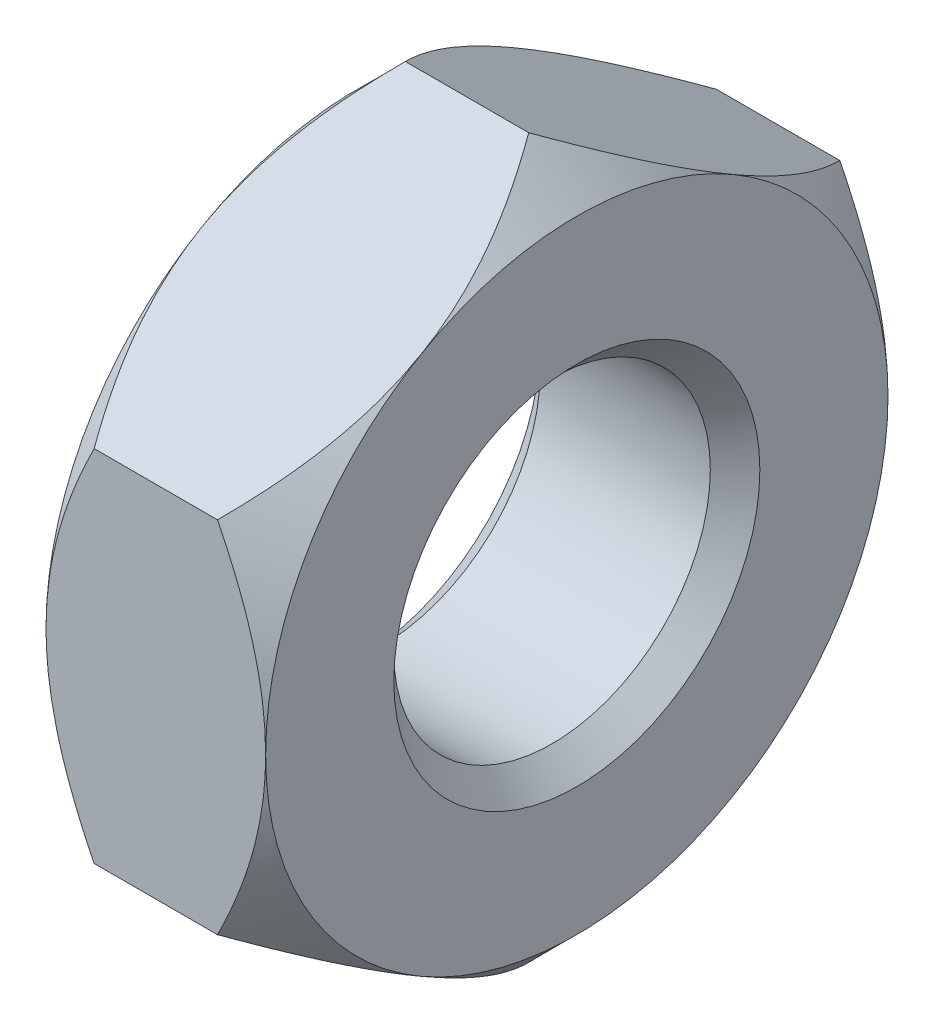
ISO-10303-21;
HEADER;
FILE_DESCRIPTION(('STEP AP214'),'2;1');
FILE_NAME('part.step','',(''),(''),'','','');
FILE_SCHEMA(('AUTOMOTIVE_DESIGN { 1 0 10303 214 1 1 1 1 }'));
ENDSEC;
DATA;
#1=APPLICATION_CONTEXT('core data for automotive mechanical design processes');
#2=APPLICATION_PROTOCOL_DEFINITION('international standard','automotive_design',2000,#1);
#3=PRODUCT_CONTEXT('',#1,'mechanical');
#4=PRODUCT('Part','Part','',(#3));
#5=PRODUCT_RELATED_PRODUCT_CATEGORY('part','',(#4));
#6=PRODUCT_DEFINITION_FORMATION('','',#4);
#7=PRODUCT_DEFINITION_CONTEXT('part definition',#1,'design');
#8=PRODUCT_DEFINITION('design','',#6,#7);
#9=PRODUCT_DEFINITION_SHAPE('','',#8);
#10=(LENGTH_UNIT() NAMED_UNIT(*) SI_UNIT(.MILLI.,.METRE.));
#11=(NAMED_UNIT(*) PLANE_ANGLE_UNIT() SI_UNIT($,.RADIAN.));
#12=(NAMED_UNIT(*) SI_UNIT($,.STERADIAN.) SOLID_ANGLE_UNIT());
#13=UNCERTAINTY_MEASURE_WITH_UNIT(LENGTH_MEASURE(1.E-05),#10,'distance_accuracy_value','');
#14=(GEOMETRIC_REPRESENTATION_CONTEXT(3) GLOBAL_UNCERTAINTY_ASSIGNED_CONTEXT((#13)) GLOBAL_UNIT_ASSIGNED_CONTEXT((#10,
#11,#12)) REPRESENTATION_CONTEXT('',''));
#15=CARTESIAN_POINT('',(0.,0.,0.));
#16=DIRECTION('',(0.,0.,1.));
#17=DIRECTION('',(1.,0.,0.));
#18=AXIS2_PLACEMENT_3D('',#15,#16,#17);
#19=CARTESIAN_POINT('',(1.7,0.,0.));
#20=DIRECTION('',(1.,0.,0.));
#21=DIRECTION('',(0.,0.,-1.));
#22=AXIS2_PLACEMENT_3D('',#19,#20,#21);
#23=CONICAL_SURFACE('',#22,10.2,0.785398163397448);
#24=CARTESIAN_POINT('',(1.31507004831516,-4.90736181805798,-8.5002));
#25=CARTESIAN_POINT('',(1.23071001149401,-4.9917346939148,-8.3540618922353));
#26=CARTESIAN_POINT('',(1.14892462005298,-5.07676599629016,-8.20678335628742));
#27=CARTESIAN_POINT('',(0.991319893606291,-5.24825298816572,-7.9097591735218));
#28=CARTESIAN_POINT('',(0.915503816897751,-5.33470942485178,-7.76001223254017));
#29=CARTESIAN_POINT('',(0.770333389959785,-5.50956203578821,-7.4571586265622));
#30=CARTESIAN_POINT('',(0.701018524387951,-5.59796648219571,-7.30403763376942));
#31=CARTESIAN_POINT('',(0.570360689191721,-5.77620843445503,-6.99531351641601));
#32=CARTESIAN_POINT('',(0.509016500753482,-5.86604571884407,-6.83971077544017));
#33=CARTESIAN_POINT('',(0.340317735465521,-6.13489147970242,-6.37405625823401));
#34=CARTESIAN_POINT('',(0.24589898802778,-6.31604623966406,-6.0602870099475));
#35=CARTESIAN_POINT('',(0.136690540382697,-6.59071980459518,-5.58453843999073));
#36=CARTESIAN_POINT('',(0.105705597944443,-6.68267601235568,-5.42526561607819));
#37=CARTESIAN_POINT('',(0.0552370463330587,-6.86737020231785,-5.10536589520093));
#38=CARTESIAN_POINT('',(0.035751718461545,-6.96010806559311,-4.94473920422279));
#39=CARTESIAN_POINT('',(0.0030816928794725,-7.18609882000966,-4.5533117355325));
#40=CARTESIAN_POINT('',(-0.00377264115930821,-7.31959483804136,-4.32208984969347));
#41=CARTESIAN_POINT('',(0.00773403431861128,-7.58634663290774,-3.86006218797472));
#42=CARTESIAN_POINT('',(0.0261038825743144,-7.71960230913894,-3.62925658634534));
#43=CARTESIAN_POINT('',(0.0869762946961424,-7.98485721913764,-3.16982160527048));
#44=CARTESIAN_POINT('',(0.12950584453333,-8.11685487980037,-2.94119495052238));
#45=CARTESIAN_POINT('',(0.236385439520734,-8.37858150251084,-2.48787114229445));
#46=CARTESIAN_POINT('',(0.300733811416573,-8.50831063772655,-2.26317368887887));
#47=CARTESIAN_POINT('',(0.433115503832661,-8.73859869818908,-1.86430306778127));
#48=CARTESIAN_POINT('',(0.497666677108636,-8.83966763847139,-1.68924652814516));
#49=CARTESIAN_POINT('',(0.637170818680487,-9.03999129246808,-1.34227578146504));
#50=CARTESIAN_POINT('',(0.712124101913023,-9.13924595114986,-1.1703616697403));
#51=CARTESIAN_POINT('',(0.870752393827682,-9.33562841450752,-0.830217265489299));
#52=CARTESIAN_POINT('',(0.954399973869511,-9.43276180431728,-0.661977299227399));
#53=CARTESIAN_POINT('',(1.1293187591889,-9.62523002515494,-0.328612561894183));
#54=CARTESIAN_POINT('',(1.22058528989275,-9.72056591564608,-0.163485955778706));
#55=CARTESIAN_POINT('',(1.31507004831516,-9.81507004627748,0.000199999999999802));
#56=B_SPLINE_CURVE_WITH_KNOTS('',3,(#24,#25,#26,#27,#28,#29,#30,#31,#32,#33,#34,#35,#36,#37,#38,
#39,#40,#41,#42,#43,#44,#45,#46,#47,#48,#49,#50,#51,#52,#53,#54,#55),.UNSPECIFIED.,.F.,.F.,(4,2,
2,2,2,2,2,2,2,2,2,2,2,2,2,4),(0.,0.565988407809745,1.13228364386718,1.70182141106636,
2.27127198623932,3.39189520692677,3.95110786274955,4.51023691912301,5.31023384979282,
6.11051117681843,6.91168416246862,7.71279572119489,8.34908108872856,8.98538572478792,
9.61974061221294,10.2537091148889),.UNSPECIFIED.);
#57=CARTESIAN_POINT('',(0.,-7.36121593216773,-4.25));
#58=VERTEX_POINT('',#57);
#59=CARTESIAN_POINT('',(1.31495457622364,-9.81495457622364,0.));
#60=VERTEX_POINT('',#59);
#61=EDGE_CURVE('E306',#58,#60,#56,.T.);
#62=ORIENTED_EDGE('',*,*,#61,.T.);
#63=CARTESIAN_POINT('',(1.31507004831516,-9.81507004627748,-0.0002));
#64=CARTESIAN_POINT('',(1.23071001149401,-9.73069717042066,0.145938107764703));
#65=CARTESIAN_POINT('',(1.14892462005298,-9.6456658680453,0.293216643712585));
#66=CARTESIAN_POINT('',(0.991319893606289,-9.47417887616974,0.590240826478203));
#67=CARTESIAN_POINT('',(0.915503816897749,-9.38772243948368,0.739987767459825));
#68=CARTESIAN_POINT('',(0.770333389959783,-9.21286982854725,1.0428413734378));
#69=CARTESIAN_POINT('',(0.70101852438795,-9.12446538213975,1.19596236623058));
#70=CARTESIAN_POINT('',(0.57036068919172,-8.94622342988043,1.50468648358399));
#71=CARTESIAN_POINT('',(0.50901650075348,-8.85638614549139,1.66028922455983));
#72=CARTESIAN_POINT('',(0.34031773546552,-8.58754038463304,2.12594374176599));
#73=CARTESIAN_POINT('',(0.245898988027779,-8.4063856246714,2.4397129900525));
#74=CARTESIAN_POINT('',(0.136690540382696,-8.13171205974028,2.91546156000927));
#75=CARTESIAN_POINT('',(0.105705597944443,-8.03975585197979,3.07473438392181));
#76=CARTESIAN_POINT('',(0.0552370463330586,-7.85506166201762,3.39463410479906));
#77=CARTESIAN_POINT('',(0.0357517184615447,-7.76232379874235,3.5552607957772));
#78=CARTESIAN_POINT('',(0.00308169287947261,-7.53633304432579,3.9466882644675));
#79=CARTESIAN_POINT('',(-0.00377264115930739,-7.4028370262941,4.17791015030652));
#80=CARTESIAN_POINT('',(0.00773403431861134,-7.13608523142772,4.63993781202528));
#81=CARTESIAN_POINT('',(0.026103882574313,-7.00282955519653,4.87074341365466));
#82=CARTESIAN_POINT('',(0.0869762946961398,-6.73757464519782,5.33017839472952));
#83=CARTESIAN_POINT('',(0.129505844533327,-6.60557698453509,5.55880504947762));
#84=CARTESIAN_POINT('',(0.236385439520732,-6.34385036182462,6.01212885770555));
#85=CARTESIAN_POINT('',(0.300733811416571,-6.21412122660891,6.23682631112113));
#86=CARTESIAN_POINT('',(0.433115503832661,-5.98383316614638,6.63569693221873));
#87=CARTESIAN_POINT('',(0.497666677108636,-5.88276422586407,6.81075347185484));
#88=CARTESIAN_POINT('',(0.637170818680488,-5.68244057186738,7.15772421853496));
#89=CARTESIAN_POINT('',(0.712124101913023,-5.5831859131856,7.3296383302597));
#90=CARTESIAN_POINT('',(0.870752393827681,-5.38680344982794,7.6697827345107));
#91=CARTESIAN_POINT('',(0.954399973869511,-5.28967006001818,7.8380227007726));
#92=CARTESIAN_POINT('',(1.1293187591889,-5.09720183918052,8.17138743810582));
#93=CARTESIAN_POINT('',(1.22058528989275,-5.00186594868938,8.33651404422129));
#94=CARTESIAN_POINT('',(1.31507004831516,-4.90736181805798,8.5002));
#95=B_SPLINE_CURVE_WITH_KNOTS('',3,(#63,#64,#65,#66,#67,#68,#69,#70,#71,#72,#73,#74,#75,#76,#77,
#78,#79,#80,#81,#82,#83,#84,#85,#86,#87,#88,#89,#90,#91,#92,#93,#94),.UNSPECIFIED.,.F.,.F.,(4,2,
2,2,2,2,2,2,2,2,2,2,2,2,2,4),(0.,0.565988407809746,1.13228364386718,1.70182141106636,
2.27127198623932,3.39189520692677,3.95110786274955,4.51023691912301,5.31023384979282,
6.11051117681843,6.91168416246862,7.71279572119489,8.34908108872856,8.98538572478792,
9.61974061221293,10.2537091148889),.UNSPECIFIED.);
#96=CARTESIAN_POINT('',(0.,-7.36121593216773,4.25));
#97=VERTEX_POINT('',#96);
#98=EDGE_CURVE('E234',#60,#97,#95,.T.);
#99=ORIENTED_EDGE('',*,*,#98,.T.);
#100=CARTESIAN_POINT('',(0.,0.,0.));
#101=DIRECTION('',(-1.,0.,0.));
#102=DIRECTION('',(0.,0.,1.));
#103=AXIS2_PLACEMENT_3D('',#100,#101,#102);
#104=CIRCLE('',#103,8.5);
#105=EDGE_CURVE('E270',#58,#97,#104,.T.);
#106=ORIENTED_EDGE('',*,*,#105,.F.);
#107=EDGE_LOOP('',(#62,#99,#106));
#108=FACE_BOUND('',#107,.T.);
#109=ADVANCED_FACE('F16',(#108),#23,.T.);
#110=CARTESIAN_POINT('',(0.,0.,8.5));
#111=VERTEX_POINT('',#110);
#112=EDGE_CURVE('E25',#97,#111,#104,.T.);
#113=ORIENTED_EDGE('',*,*,#112,.F.);
#114=CARTESIAN_POINT('',(1.31495457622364,-4.90747728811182,8.5));
#115=VERTEX_POINT('',#114);
#116=EDGE_CURVE('E235',#97,#115,#95,.T.);
#117=ORIENTED_EDGE('',*,*,#116,.T.);
#118=CARTESIAN_POINT('',(4.92982439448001,-10.3976046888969,8.5));
#119=CARTESIAN_POINT('',(4.73584015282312,-10.1469934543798,8.5));
#120=CARTESIAN_POINT('',(4.54355058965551,-9.89504977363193,8.5));
#121=CARTESIAN_POINT('',(4.16314016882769,-9.38794662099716,8.5));
#122=CARTESIAN_POINT('',(3.97502028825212,-9.13278641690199,8.5));
#123=CARTESIAN_POINT('',(3.60239061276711,-8.61683688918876,8.5));
#124=CARTESIAN_POINT('',(3.41791975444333,-8.3560193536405,8.5));
#125=CARTESIAN_POINT('',(3.0552488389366,-7.83007479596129,8.5));
#126=CARTESIAN_POINT('',(2.87704835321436,-7.56494807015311,8.5));
#127=CARTESIAN_POINT('',(2.51692288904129,-7.01209310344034,8.5));
#128=CARTESIAN_POINT('',(2.33552016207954,-6.72402296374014,8.5));
#129=CARTESIAN_POINT('',(1.98375772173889,-6.1411085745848,8.5));
#130=CARTESIAN_POINT('',(1.81339990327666,-5.84626317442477,8.5));
#131=CARTESIAN_POINT('',(1.48733860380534,-5.24968132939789,8.5));
#132=CARTESIAN_POINT('',(1.33159215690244,-4.94796855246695,8.5));
#133=CARTESIAN_POINT('',(1.0382435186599,-4.33591717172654,8.5));
#134=CARTESIAN_POINT('',(0.900632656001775,-4.02558277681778,8.5));
#135=CARTESIAN_POINT('',(0.661736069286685,-3.4284400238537,8.5));
#136=CARTESIAN_POINT('',(0.558157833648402,-3.14255819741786,8.5));
#137=CARTESIAN_POINT('',(0.37387227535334,-2.56337765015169,8.5));
#138=CARTESIAN_POINT('',(0.293166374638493,-2.27007846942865,8.5));
#139=CARTESIAN_POINT('',(0.160395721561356,-1.68300459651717,8.5));
#140=CARTESIAN_POINT('',(0.107800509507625,-1.38935194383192,8.5));
#141=CARTESIAN_POINT('',(0.0323716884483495,-0.798227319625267,8.5));
#142=CARTESIAN_POINT('',(0.00953150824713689,-0.500756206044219,8.5));
#143=CARTESIAN_POINT('',(-0.00435800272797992,0.0810962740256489,8.5));
#144=CARTESIAN_POINT('',(0.00316510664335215,0.365443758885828,8.5));
#145=CARTESIAN_POINT('',(0.0462727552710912,0.931988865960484,8.5));
#146=CARTESIAN_POINT('',(0.081859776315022,1.21418629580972,8.5));
#147=CARTESIAN_POINT('',(0.179663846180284,1.77917741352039,8.5));
#148=CARTESIAN_POINT('',(0.242356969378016,2.06188725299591,8.5));
#149=CARTESIAN_POINT('',(0.390848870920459,2.62105501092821,8.5));
#150=CARTESIAN_POINT('',(0.476646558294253,2.89751322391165,8.5));
#151=CARTESIAN_POINT('',(0.671970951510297,3.45641991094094,8.5));
#152=CARTESIAN_POINT('',(0.782421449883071,3.73854170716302,8.5));
#153=CARTESIAN_POINT('',(1.02041263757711,4.29554627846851,8.5));
#154=CARTESIAN_POINT('',(1.14796095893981,4.57042575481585,8.5));
#155=CARTESIAN_POINT('',(1.41712501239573,5.11423168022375,8.5));
#156=CARTESIAN_POINT('',(1.55878381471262,5.38313663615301,8.5));
#157=CARTESIAN_POINT('',(1.85305536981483,5.9147914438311,8.5));
#158=CARTESIAN_POINT('',(2.00566645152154,6.17754222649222,8.5));
#159=CARTESIAN_POINT('',(2.31196601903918,6.68486658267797,8.5));
#160=CARTESIAN_POINT('',(2.46523033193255,6.92969761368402,8.5));
#161=CARTESIAN_POINT('',(2.77830199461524,7.41515269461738,8.5));
#162=CARTESIAN_POINT('',(2.93810983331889,7.65577642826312,8.5));
#163=CARTESIAN_POINT('',(3.26180673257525,8.1314376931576,8.5));
#164=CARTESIAN_POINT('',(3.42565290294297,8.36650451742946,8.5));
#165=CARTESIAN_POINT('',(3.75775204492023,8.83341045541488,8.5));
#166=CARTESIAN_POINT('',(3.92600378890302,9.06525044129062,8.5));
#167=CARTESIAN_POINT('',(4.09605937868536,9.29573621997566,8.5));
#168=B_SPLINE_CURVE_WITH_KNOTS('',3,(#118,#119,#120,#121,#122,#123,#124,#125,#126,#127,#128,
#129,#130,#131,#132,#133,#134,#135,#136,#137,#138,#139,#140,#141,#142,#143,#144,#145,#146,#147,
#148,#149,#150,#151,#152,#153,#154,#155,#156,#157,#158,#159,#160,#161,#162,#163,#164,#165,#166,
#167),.UNSPECIFIED.,.F.,.F.,(4,2,2,2,2,2,2,2,2,2,2,2,2,2,2,2,2,2,2,2,2,2,2,2,4),(0.,
0.950765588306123,1.90175166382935,2.86005818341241,3.81829908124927,4.83938680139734,
5.86064924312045,6.87880771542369,7.89647758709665,8.8078977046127,9.7193744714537,
10.6129828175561,11.506393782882,12.3583011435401,13.210283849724,14.0778801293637,
14.9454354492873,15.8536582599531,16.7622878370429,17.6737812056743,18.5851357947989,
19.4515528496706,20.3180347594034,21.177583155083,22.0368945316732),.UNSPECIFIED.);
#169=EDGE_CURVE('E244',#115,#111,#168,.T.);
#170=ORIENTED_EDGE('',*,*,#169,.T.);
#171=EDGE_LOOP('',(#113,#117,#170));
#172=FACE_BOUND('',#171,.T.);
#173=ADVANCED_FACE('F296',(#172),#23,.T.);
#174=CARTESIAN_POINT('',(0.,7.36121593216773,4.25));
#175=VERTEX_POINT('',#174);
#176=EDGE_CURVE('E11',#111,#175,#104,.T.);
#177=ORIENTED_EDGE('',*,*,#176,.F.);
#178=CARTESIAN_POINT('',(1.31495457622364,4.90747728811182,8.5));
#179=VERTEX_POINT('',#178);
#180=EDGE_CURVE('E135',#111,#179,#168,.T.);
#181=ORIENTED_EDGE('',*,*,#180,.T.);
#182=CARTESIAN_POINT('',(1.31507004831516,4.90736181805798,8.5002));
#183=CARTESIAN_POINT('',(1.23071001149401,4.9917346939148,8.3540618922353));
#184=CARTESIAN_POINT('',(1.14892462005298,5.07676599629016,8.20678335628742));
#185=CARTESIAN_POINT('',(0.991319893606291,5.24825298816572,7.9097591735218));
#186=CARTESIAN_POINT('',(0.915503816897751,5.33470942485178,7.76001223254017));
#187=CARTESIAN_POINT('',(0.770333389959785,5.50956203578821,7.4571586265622));
#188=CARTESIAN_POINT('',(0.701018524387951,5.59796648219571,7.30403763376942));
#189=CARTESIAN_POINT('',(0.570360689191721,5.77620843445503,6.99531351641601));
#190=CARTESIAN_POINT('',(0.509016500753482,5.86604571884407,6.83971077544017));
#191=CARTESIAN_POINT('',(0.340317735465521,6.13489147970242,6.37405625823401));
#192=CARTESIAN_POINT('',(0.24589898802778,6.31604623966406,6.0602870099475));
#193=CARTESIAN_POINT('',(0.136690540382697,6.59071980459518,5.58453843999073));
#194=CARTESIAN_POINT('',(0.105705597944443,6.68267601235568,5.42526561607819));
#195=CARTESIAN_POINT('',(0.0552370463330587,6.86737020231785,5.10536589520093));
#196=CARTESIAN_POINT('',(0.035751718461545,6.96010806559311,4.94473920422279));
#197=CARTESIAN_POINT('',(0.0030816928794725,7.18609882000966,4.5533117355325));
#198=CARTESIAN_POINT('',(-0.00377264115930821,7.31959483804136,4.32208984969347));
#199=CARTESIAN_POINT('',(0.00773403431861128,7.58634663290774,3.86006218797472));
#200=CARTESIAN_POINT('',(0.0261038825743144,7.71960230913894,3.62925658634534));
#201=CARTESIAN_POINT('',(0.0869762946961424,7.98485721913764,3.16982160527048));
#202=CARTESIAN_POINT('',(0.12950584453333,8.11685487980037,2.94119495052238));
#203=CARTESIAN_POINT('',(0.236385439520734,8.37858150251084,2.48787114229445));
#204=CARTESIAN_POINT('',(0.300733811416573,8.50831063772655,2.26317368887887));
#205=CARTESIAN_POINT('',(0.433115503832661,8.73859869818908,1.86430306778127));
#206=CARTESIAN_POINT('',(0.497666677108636,8.83966763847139,1.68924652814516));
#207=CARTESIAN_POINT('',(0.637170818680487,9.03999129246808,1.34227578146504));
#208=CARTESIAN_POINT('',(0.712124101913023,9.13924595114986,1.1703616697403));
#209=CARTESIAN_POINT('',(0.870752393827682,9.33562841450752,0.830217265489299));
#210=CARTESIAN_POINT('',(0.954399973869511,9.43276180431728,0.661977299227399));
#211=CARTESIAN_POINT('',(1.1293187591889,9.62523002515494,0.328612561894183));
#212=CARTESIAN_POINT('',(1.22058528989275,9.72056591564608,0.163485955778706));
#213=CARTESIAN_POINT('',(1.31507004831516,9.81507004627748,-0.000199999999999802));
#214=B_SPLINE_CURVE_WITH_KNOTS('',3,(#182,#183,#184,#185,#186,#187,#188,#189,#190,#191,#192,
#193,#194,#195,#196,#197,#198,#199,#200,#201,#202,#203,#204,#205,#206,#207,#208,#209,#210,#211,
#212,#213),.UNSPECIFIED.,.F.,.F.,(4,2,2,2,2,2,2,2,2,2,2,2,2,2,2,4),(0.,0.565988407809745,
1.13228364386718,1.70182141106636,2.27127198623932,3.39189520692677,3.95110786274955,
4.51023691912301,5.31023384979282,6.11051117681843,6.91168416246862,7.71279572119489,
8.34908108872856,8.98538572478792,9.61974061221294,10.2537091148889),.UNSPECIFIED.);
#215=EDGE_CURVE('E136',#179,#175,#214,.T.);
#216=ORIENTED_EDGE('',*,*,#215,.T.);
#217=EDGE_LOOP('',(#177,#181,#216));
#218=FACE_BOUND('',#217,.T.);
#219=ADVANCED_FACE('F134',(#218),#23,.T.);
#220=CARTESIAN_POINT('',(4.92982439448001,-10.3976046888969,-8.5));
#221=CARTESIAN_POINT('',(4.73584015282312,-10.1469934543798,-8.5));
#222=CARTESIAN_POINT('',(4.54355058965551,-9.89504977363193,-8.5));
#223=CARTESIAN_POINT('',(4.16314016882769,-9.38794662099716,-8.5));
#224=CARTESIAN_POINT('',(3.97502028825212,-9.13278641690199,-8.5));
#225=CARTESIAN_POINT('',(3.60239061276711,-8.61683688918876,-8.5));
#226=CARTESIAN_POINT('',(3.41791975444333,-8.3560193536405,-8.5));
#227=CARTESIAN_POINT('',(3.0552488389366,-7.83007479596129,-8.5));
#228=CARTESIAN_POINT('',(2.87704835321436,-7.56494807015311,-8.5));
#229=CARTESIAN_POINT('',(2.51692288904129,-7.01209310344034,-8.5));
#230=CARTESIAN_POINT('',(2.33552016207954,-6.72402296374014,-8.5));
#231=CARTESIAN_POINT('',(1.98375772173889,-6.1411085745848,-8.5));
#232=CARTESIAN_POINT('',(1.81339990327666,-5.84626317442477,-8.5));
#233=CARTESIAN_POINT('',(1.48733860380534,-5.24968132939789,-8.5));
#234=CARTESIAN_POINT('',(1.33159215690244,-4.94796855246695,-8.5));
#235=CARTESIAN_POINT('',(1.0382435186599,-4.33591717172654,-8.5));
#236=CARTESIAN_POINT('',(0.900632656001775,-4.02558277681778,-8.5));
#237=CARTESIAN_POINT('',(0.661736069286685,-3.4284400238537,-8.5));
#238=CARTESIAN_POINT('',(0.558157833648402,-3.14255819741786,-8.5));
#239=CARTESIAN_POINT('',(0.37387227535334,-2.56337765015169,-8.5));
#240=CARTESIAN_POINT('',(0.293166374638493,-2.27007846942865,-8.5));
#241=CARTESIAN_POINT('',(0.160395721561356,-1.68300459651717,-8.5));
#242=CARTESIAN_POINT('',(0.107800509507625,-1.38935194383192,-8.5));
#243=CARTESIAN_POINT('',(0.0323716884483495,-0.798227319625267,-8.5));
#244=CARTESIAN_POINT('',(0.00953150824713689,-0.500756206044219,-8.5));
#245=CARTESIAN_POINT('',(-0.00435800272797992,0.0810962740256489,-8.5));
#246=CARTESIAN_POINT('',(0.00316510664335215,0.365443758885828,-8.5));
#247=CARTESIAN_POINT('',(0.0462727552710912,0.931988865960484,-8.5));
#248=CARTESIAN_POINT('',(0.081859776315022,1.21418629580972,-8.5));
#249=CARTESIAN_POINT('',(0.179663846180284,1.77917741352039,-8.5));
#250=CARTESIAN_POINT('',(0.242356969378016,2.06188725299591,-8.5));
#251=CARTESIAN_POINT('',(0.390848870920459,2.62105501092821,-8.5));
#252=CARTESIAN_POINT('',(0.476646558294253,2.89751322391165,-8.5));
#253=CARTESIAN_POINT('',(0.671970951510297,3.45641991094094,-8.5));
#254=CARTESIAN_POINT('',(0.782421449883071,3.73854170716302,-8.5));
#255=CARTESIAN_POINT('',(1.02041263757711,4.29554627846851,-8.5));
#256=CARTESIAN_POINT('',(1.14796095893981,4.57042575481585,-8.5));
#257=CARTESIAN_POINT('',(1.41712501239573,5.11423168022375,-8.5));
#258=CARTESIAN_POINT('',(1.55878381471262,5.38313663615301,-8.5));
#259=CARTESIAN_POINT('',(1.85305536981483,5.9147914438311,-8.5));
#260=CARTESIAN_POINT('',(2.00566645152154,6.17754222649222,-8.5));
#261=CARTESIAN_POINT('',(2.31196601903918,6.68486658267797,-8.5));
#262=CARTESIAN_POINT('',(2.46523033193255,6.92969761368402,-8.5));
#263=CARTESIAN_POINT('',(2.77830199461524,7.41515269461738,-8.5));
#264=CARTESIAN_POINT('',(2.93810983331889,7.65577642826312,-8.5));
#265=CARTESIAN_POINT('',(3.26180673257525,8.1314376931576,-8.5));
#266=CARTESIAN_POINT('',(3.42565290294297,8.36650451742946,-8.5));
#267=CARTESIAN_POINT('',(3.75775204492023,8.83341045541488,-8.5));
#268=CARTESIAN_POINT('',(3.92600378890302,9.06525044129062,-8.5));
#269=CARTESIAN_POINT('',(4.09605937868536,9.29573621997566,-8.5));
#270=B_SPLINE_CURVE_WITH_KNOTS('',3,(#220,#221,#222,#223,#224,#225,#226,#227,#228,#229,#230,
#231,#232,#233,#234,#235,#236,#237,#238,#239,#240,#241,#242,#243,#244,#245,#246,#247,#248,#249,
#250,#251,#252,#253,#254,#255,#256,#257,#258,#259,#260,#261,#262,#263,#264,#265,#266,#267,#268,
#269),.UNSPECIFIED.,.F.,.F.,(4,2,2,2,2,2,2,2,2,2,2,2,2,2,2,2,2,2,2,2,2,2,2,2,4),(0.,
0.950765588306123,1.90175166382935,2.86005818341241,3.81829908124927,4.83938680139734,
5.86064924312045,6.87880771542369,7.89647758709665,8.8078977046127,9.7193744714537,
10.6129828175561,11.506393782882,12.3583011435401,13.210283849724,14.0778801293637,
14.9454354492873,15.8536582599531,16.7622878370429,17.6737812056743,18.5851357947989,
19.4515528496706,20.3180347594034,21.177583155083,22.0368945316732),.UNSPECIFIED.);
#271=CARTESIAN_POINT('',(0.,0.,-8.5));
#272=VERTEX_POINT('',#271);
#273=CARTESIAN_POINT('',(1.31495457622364,-4.90747728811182,-8.5));
#274=VERTEX_POINT('',#273);
#275=EDGE_CURVE('E362',#272,#274,#270,.F.);
#276=ORIENTED_EDGE('',*,*,#275,.T.);
#277=EDGE_CURVE('E310',#274,#58,#56,.T.);
#278=ORIENTED_EDGE('',*,*,#277,.T.);
#279=EDGE_CURVE('E126',#272,#58,#104,.T.);
#280=ORIENTED_EDGE('',*,*,#279,.F.);
#281=EDGE_LOOP('',(#276,#278,#280));
#282=FACE_BOUND('',#281,.T.);
#283=ADVANCED_FACE('F369',(#282),#23,.T.);
#284=CARTESIAN_POINT('',(0.,7.36121593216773,-4.25));
#285=VERTEX_POINT('',#284);
#286=EDGE_CURVE('E24',#175,#285,#104,.T.);
#287=ORIENTED_EDGE('',*,*,#286,.F.);
#288=CARTESIAN_POINT('',(1.31495457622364,9.81495457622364,0.));
#289=VERTEX_POINT('',#288);
#290=EDGE_CURVE('E117',#175,#289,#214,.T.);
#291=ORIENTED_EDGE('',*,*,#290,.T.);
#292=CARTESIAN_POINT('',(1.31507004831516,9.81507004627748,0.0002));
#293=CARTESIAN_POINT('',(1.23071001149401,9.73069717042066,-0.145938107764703));
#294=CARTESIAN_POINT('',(1.14892462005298,9.6456658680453,-0.293216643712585));
#295=CARTESIAN_POINT('',(0.991319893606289,9.47417887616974,-0.590240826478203));
#296=CARTESIAN_POINT('',(0.915503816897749,9.38772243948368,-0.739987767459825));
#297=CARTESIAN_POINT('',(0.770333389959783,9.21286982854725,-1.0428413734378));
#298=CARTESIAN_POINT('',(0.70101852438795,9.12446538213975,-1.19596236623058));
#299=CARTESIAN_POINT('',(0.57036068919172,8.94622342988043,-1.50468648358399));
#300=CARTESIAN_POINT('',(0.50901650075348,8.85638614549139,-1.66028922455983));
#301=CARTESIAN_POINT('',(0.34031773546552,8.58754038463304,-2.12594374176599));
#302=CARTESIAN_POINT('',(0.245898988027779,8.4063856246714,-2.4397129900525));
#303=CARTESIAN_POINT('',(0.136690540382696,8.13171205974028,-2.91546156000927));
#304=CARTESIAN_POINT('',(0.105705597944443,8.03975585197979,-3.07473438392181));
#305=CARTESIAN_POINT('',(0.0552370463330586,7.85506166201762,-3.39463410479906));
#306=CARTESIAN_POINT('',(0.0357517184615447,7.76232379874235,-3.5552607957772));
#307=CARTESIAN_POINT('',(0.00308169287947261,7.53633304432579,-3.9466882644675));
#308=CARTESIAN_POINT('',(-0.00377264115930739,7.4028370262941,-4.17791015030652));
#309=CARTESIAN_POINT('',(0.00773403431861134,7.13608523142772,-4.63993781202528));
#310=CARTESIAN_POINT('',(0.026103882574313,7.00282955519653,-4.87074341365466));
#311=CARTESIAN_POINT('',(0.0869762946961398,6.73757464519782,-5.33017839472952));
#312=CARTESIAN_POINT('',(0.129505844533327,6.60557698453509,-5.55880504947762));
#313=CARTESIAN_POINT('',(0.236385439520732,6.34385036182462,-6.01212885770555));
#314=CARTESIAN_POINT('',(0.300733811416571,6.21412122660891,-6.23682631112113));
#315=CARTESIAN_POINT('',(0.433115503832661,5.98383316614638,-6.63569693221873));
#316=CARTESIAN_POINT('',(0.497666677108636,5.88276422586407,-6.81075347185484));
#317=CARTESIAN_POINT('',(0.637170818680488,5.68244057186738,-7.15772421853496));
#318=CARTESIAN_POINT('',(0.712124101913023,5.5831859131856,-7.3296383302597));
#319=CARTESIAN_POINT('',(0.870752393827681,5.38680344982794,-7.6697827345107));
#320=CARTESIAN_POINT('',(0.954399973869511,5.28967006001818,-7.8380227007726));
#321=CARTESIAN_POINT('',(1.1293187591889,5.09720183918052,-8.17138743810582));
#322=CARTESIAN_POINT('',(1.22058528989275,5.00186594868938,-8.33651404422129));
#323=CARTESIAN_POINT('',(1.31507004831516,4.90736181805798,-8.5002));
#324=B_SPLINE_CURVE_WITH_KNOTS('',3,(#292,#293,#294,#295,#296,#297,#298,#299,#300,#301,#302,
#303,#304,#305,#306,#307,#308,#309,#310,#311,#312,#313,#314,#315,#316,#317,#318,#319,#320,#321,
#322,#323),.UNSPECIFIED.,.F.,.F.,(4,2,2,2,2,2,2,2,2,2,2,2,2,2,2,4),(0.,0.565988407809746,
1.13228364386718,1.70182141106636,2.27127198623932,3.39189520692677,3.95110786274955,
4.51023691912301,5.31023384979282,6.11051117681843,6.91168416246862,7.71279572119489,
8.34908108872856,8.98538572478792,9.61974061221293,10.2537091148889),.UNSPECIFIED.);
#325=EDGE_CURVE('E106',#289,#285,#324,.T.);
#326=ORIENTED_EDGE('',*,*,#325,.T.);
#327=EDGE_LOOP('',(#287,#291,#326));
#328=FACE_BOUND('',#327,.T.);
#329=ADVANCED_FACE('F115',(#328),#23,.T.);
#330=CARTESIAN_POINT('',(6.,0.,0.));
#331=DIRECTION('',(-1.,0.,0.));
#332=DIRECTION('',(0.,0.,1.));
#333=AXIS2_PLACEMENT_3D('',#330,#331,#332);
#334=CONICAL_SURFACE('',#333,8.5,0.785398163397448);
#335=CARTESIAN_POINT('',(4.68492995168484,4.90736181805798,-8.5002));
#336=CARTESIAN_POINT('',(4.76928998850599,4.9917346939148,-8.3540618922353));
#337=CARTESIAN_POINT('',(4.85107537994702,5.07676599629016,-8.20678335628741));
#338=CARTESIAN_POINT('',(5.00868010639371,5.24825298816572,-7.90975917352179));
#339=CARTESIAN_POINT('',(5.08449618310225,5.33470942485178,-7.76001223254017));
#340=CARTESIAN_POINT('',(5.22966661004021,5.50956203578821,-7.4571586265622));
#341=CARTESIAN_POINT('',(5.29898147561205,5.59796648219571,-7.30403763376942));
#342=CARTESIAN_POINT('',(5.42963931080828,5.77620843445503,-6.99531351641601));
#343=CARTESIAN_POINT('',(5.49098349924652,5.86604571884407,-6.83971077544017));
#344=CARTESIAN_POINT('',(5.65968226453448,6.13489147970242,-6.37405625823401));
#345=CARTESIAN_POINT('',(5.75410101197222,6.31604623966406,-6.0602870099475));
#346=CARTESIAN_POINT('',(5.8633094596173,6.59071980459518,-5.58453843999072));
#347=CARTESIAN_POINT('',(5.89429440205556,6.68267601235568,-5.42526561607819));
#348=CARTESIAN_POINT('',(5.94476295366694,6.86737020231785,-5.10536589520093));
#349=CARTESIAN_POINT('',(5.96424828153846,6.96010806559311,-4.94473920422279));
#350=CARTESIAN_POINT('',(5.99691830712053,7.18609882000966,-4.5533117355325));
#351=CARTESIAN_POINT('',(6.00377264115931,7.31959483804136,-4.32208984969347));
#352=CARTESIAN_POINT('',(5.99226596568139,7.58634663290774,-3.86006218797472));
#353=CARTESIAN_POINT('',(5.97389611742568,7.71960230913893,-3.62925658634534));
#354=CARTESIAN_POINT('',(5.91302370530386,7.98485721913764,-3.16982160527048));
#355=CARTESIAN_POINT('',(5.87049415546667,8.11685487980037,-2.94119495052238));
#356=CARTESIAN_POINT('',(5.76361456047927,8.37858150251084,-2.48787114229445));
#357=CARTESIAN_POINT('',(5.69926618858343,8.50831063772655,-2.26317368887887));
#358=CARTESIAN_POINT('',(5.56688449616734,8.73859869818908,-1.86430306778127));
#359=CARTESIAN_POINT('',(5.50233332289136,8.83966763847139,-1.68924652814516));
#360=CARTESIAN_POINT('',(5.36282918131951,9.03999129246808,-1.34227578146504));
#361=CARTESIAN_POINT('',(5.28787589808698,9.13924595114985,-1.1703616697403));
#362=CARTESIAN_POINT('',(5.12924760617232,9.33562841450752,-0.830217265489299));
#363=CARTESIAN_POINT('',(5.04560002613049,9.43276180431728,-0.6619772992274));
#364=CARTESIAN_POINT('',(4.87068124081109,9.62523002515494,-0.328612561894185));
#365=CARTESIAN_POINT('',(4.77941471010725,9.72056591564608,-0.163485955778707));
#366=CARTESIAN_POINT('',(4.68492995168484,9.81507004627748,0.000199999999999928));
#367=B_SPLINE_CURVE_WITH_KNOTS('',3,(#335,#336,#337,#338,#339,#340,#341,#342,#343,#344,#345,
#346,#347,#348,#349,#350,#351,#352,#353,#354,#355,#356,#357,#358,#359,#360,#361,#362,#363,#364,
#365,#366),.UNSPECIFIED.,.F.,.F.,(4,2,2,2,2,2,2,2,2,2,2,2,2,2,2,4),(0.,0.565988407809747,
1.13228364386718,1.70182141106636,2.27127198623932,3.39189520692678,3.95110786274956,
4.51023691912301,5.31023384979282,6.11051117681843,6.91168416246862,7.71279572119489,
8.34908108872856,8.98538572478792,9.61974061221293,10.2537091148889),.UNSPECIFIED.);
#368=CARTESIAN_POINT('',(6.,7.36121593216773,-4.25));
#369=VERTEX_POINT('',#368);
#370=CARTESIAN_POINT('',(4.68504542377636,9.81495457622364,0.));
#371=VERTEX_POINT('',#370);
#372=EDGE_CURVE('E194',#369,#371,#367,.T.);
#373=ORIENTED_EDGE('',*,*,#372,.T.);
#374=CARTESIAN_POINT('',(4.68492995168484,9.81507004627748,-0.0002));
#375=CARTESIAN_POINT('',(4.76928998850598,9.73069717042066,0.145938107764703));
#376=CARTESIAN_POINT('',(4.85107537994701,9.6456658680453,0.293216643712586));
#377=CARTESIAN_POINT('',(5.00868010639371,9.47417887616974,0.590240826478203));
#378=CARTESIAN_POINT('',(5.08449618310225,9.38772243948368,0.739987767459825));
#379=CARTESIAN_POINT('',(5.22966661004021,9.21286982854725,1.0428413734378));
#380=CARTESIAN_POINT('',(5.29898147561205,9.12446538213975,1.19596236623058));
#381=CARTESIAN_POINT('',(5.42963931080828,8.94622342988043,1.50468648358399));
#382=CARTESIAN_POINT('',(5.49098349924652,8.85638614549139,1.66028922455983));
#383=CARTESIAN_POINT('',(5.65968226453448,8.58754038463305,2.12594374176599));
#384=CARTESIAN_POINT('',(5.75410101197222,8.4063856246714,2.4397129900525));
#385=CARTESIAN_POINT('',(5.8633094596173,8.13171205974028,2.91546156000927));
#386=CARTESIAN_POINT('',(5.89429440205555,8.03975585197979,3.07473438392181));
#387=CARTESIAN_POINT('',(5.94476295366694,7.85506166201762,3.39463410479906));
#388=CARTESIAN_POINT('',(5.96424828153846,7.76232379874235,3.5552607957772));
#389=CARTESIAN_POINT('',(5.99691830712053,7.53633304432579,3.9466882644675));
#390=CARTESIAN_POINT('',(6.00377264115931,7.4028370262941,4.17791015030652));
#391=CARTESIAN_POINT('',(5.99226596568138,7.13608523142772,4.63993781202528));
#392=CARTESIAN_POINT('',(5.97389611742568,7.00282955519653,4.87074341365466));
#393=CARTESIAN_POINT('',(5.91302370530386,6.73757464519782,5.33017839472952));
#394=CARTESIAN_POINT('',(5.87049415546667,6.60557698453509,5.55880504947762));
#395=CARTESIAN_POINT('',(5.76361456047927,6.34385036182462,6.01212885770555));
#396=CARTESIAN_POINT('',(5.69926618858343,6.21412122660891,6.23682631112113));
#397=CARTESIAN_POINT('',(5.56688449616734,5.98383316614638,6.63569693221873));
#398=CARTESIAN_POINT('',(5.50233332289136,5.88276422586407,6.81075347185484));
#399=CARTESIAN_POINT('',(5.36282918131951,5.68244057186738,7.15772421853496));
#400=CARTESIAN_POINT('',(5.28787589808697,5.58318591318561,7.3296383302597));
#401=CARTESIAN_POINT('',(5.12924760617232,5.38680344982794,7.6697827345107));
#402=CARTESIAN_POINT('',(5.04560002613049,5.28967006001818,7.8380227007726));
#403=CARTESIAN_POINT('',(4.87068124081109,5.09720183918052,8.17138743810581));
#404=CARTESIAN_POINT('',(4.77941471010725,5.00186594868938,8.33651404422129));
#405=CARTESIAN_POINT('',(4.68492995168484,4.90736181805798,8.5002));
#406=B_SPLINE_CURVE_WITH_KNOTS('',3,(#374,#375,#376,#377,#378,#379,#380,#381,#382,#383,#384,
#385,#386,#387,#388,#389,#390,#391,#392,#393,#394,#395,#396,#397,#398,#399,#400,#401,#402,#403,
#404,#405),.UNSPECIFIED.,.F.,.F.,(4,2,2,2,2,2,2,2,2,2,2,2,2,2,2,4),(0.,0.565988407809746,
1.13228364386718,1.70182141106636,2.27127198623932,3.39189520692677,3.95110786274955,
4.51023691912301,5.31023384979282,6.11051117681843,6.91168416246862,7.71279572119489,
8.34908108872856,8.98538572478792,9.61974061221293,10.2537091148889),.UNSPECIFIED.);
#407=CARTESIAN_POINT('',(6.,7.36121593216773,4.25));
#408=VERTEX_POINT('',#407);
#409=EDGE_CURVE('E145',#371,#408,#406,.T.);
#410=ORIENTED_EDGE('',*,*,#409,.T.);
#411=CARTESIAN_POINT('',(6.,0.,0.));
#412=DIRECTION('',(-1.,0.,0.));
#413=DIRECTION('',(0.,0.,1.));
#414=AXIS2_PLACEMENT_3D('',#411,#412,#413);
#415=CIRCLE('',#414,8.5);
#416=EDGE_CURVE('E269',#408,#369,#415,.T.);
#417=ORIENTED_EDGE('',*,*,#416,.T.);
#418=EDGE_LOOP('',(#373,#410,#417));
#419=FACE_BOUND('',#418,.T.);
#420=ADVANCED_FACE('F189',(#419),#334,.T.);
#421=CARTESIAN_POINT('',(6.,0.,8.5));
#422=VERTEX_POINT('',#421);
#423=EDGE_CURVE('E253',#422,#408,#415,.T.);
#424=ORIENTED_EDGE('',*,*,#423,.T.);
#425=CARTESIAN_POINT('',(4.68504542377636,4.90747728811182,8.5));
#426=VERTEX_POINT('',#425);
#427=EDGE_CURVE('E152',#408,#426,#406,.T.);
#428=ORIENTED_EDGE('',*,*,#427,.T.);
#429=CARTESIAN_POINT('',(1.07017560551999,-10.3976046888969,8.5));
#430=CARTESIAN_POINT('',(1.26415984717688,-10.1469934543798,8.5));
#431=CARTESIAN_POINT('',(1.45644941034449,-9.89504977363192,8.5));
#432=CARTESIAN_POINT('',(1.83685983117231,-9.38794662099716,8.5));
#433=CARTESIAN_POINT('',(2.02497971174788,-9.13278641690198,8.5));
#434=CARTESIAN_POINT('',(2.39760938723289,-8.61683688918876,8.5));
#435=CARTESIAN_POINT('',(2.58208024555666,-8.3560193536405,8.5));
#436=CARTESIAN_POINT('',(2.9447511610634,-7.83007479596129,8.5));
#437=CARTESIAN_POINT('',(3.12295164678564,-7.5649480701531,8.5));
#438=CARTESIAN_POINT('',(3.48307711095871,-7.01209310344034,8.5));
#439=CARTESIAN_POINT('',(3.66447983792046,-6.72402296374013,8.5));
#440=CARTESIAN_POINT('',(4.01624227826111,-6.1411085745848,8.5));
#441=CARTESIAN_POINT('',(4.18660009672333,-5.84626317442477,8.5));
#442=CARTESIAN_POINT('',(4.51266139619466,-5.24968132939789,8.5));
#443=CARTESIAN_POINT('',(4.66840784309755,-4.94796855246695,8.5));
#444=CARTESIAN_POINT('',(4.96175648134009,-4.33591717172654,8.5));
#445=CARTESIAN_POINT('',(5.09936734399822,-4.02558277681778,8.5));
#446=CARTESIAN_POINT('',(5.33826393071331,-3.4284400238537,8.5));
#447=CARTESIAN_POINT('',(5.44184216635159,-3.14255819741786,8.5));
#448=CARTESIAN_POINT('',(5.62612772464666,-2.56337765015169,8.5));
#449=CARTESIAN_POINT('',(5.7068336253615,-2.27007846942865,8.5));
#450=CARTESIAN_POINT('',(5.83960427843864,-1.68300459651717,8.5));
#451=CARTESIAN_POINT('',(5.89219949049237,-1.38935194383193,8.5));
#452=CARTESIAN_POINT('',(5.96762831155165,-0.798227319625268,8.5));
#453=CARTESIAN_POINT('',(5.99046849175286,-0.50075620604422,8.5));
#454=CARTESIAN_POINT('',(6.00435800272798,0.0810962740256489,8.5));
#455=CARTESIAN_POINT('',(5.99683489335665,0.365443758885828,8.5));
#456=CARTESIAN_POINT('',(5.95372724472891,0.931988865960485,8.5));
#457=CARTESIAN_POINT('',(5.91814022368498,1.21418629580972,8.5));
#458=CARTESIAN_POINT('',(5.82033615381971,1.77917741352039,8.5));
#459=CARTESIAN_POINT('',(5.75764303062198,2.06188725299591,8.5));
#460=CARTESIAN_POINT('',(5.60915112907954,2.62105501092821,8.5));
#461=CARTESIAN_POINT('',(5.52335344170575,2.89751322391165,8.5));
#462=CARTESIAN_POINT('',(5.32802904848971,3.45641991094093,8.5));
#463=CARTESIAN_POINT('',(5.21757855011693,3.73854170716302,8.5));
#464=CARTESIAN_POINT('',(4.97958736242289,4.29554627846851,8.5));
#465=CARTESIAN_POINT('',(4.85203904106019,4.57042575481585,8.5));
#466=CARTESIAN_POINT('',(4.58287498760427,5.11423168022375,8.5));
#467=CARTESIAN_POINT('',(4.44121618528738,5.38313663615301,8.5));
#468=CARTESIAN_POINT('',(4.14694463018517,5.9147914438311,8.5));
#469=CARTESIAN_POINT('',(3.99433354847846,6.17754222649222,8.5));
#470=CARTESIAN_POINT('',(3.68803398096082,6.68486658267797,8.5));
#471=CARTESIAN_POINT('',(3.53476966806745,6.92969761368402,8.5));
#472=CARTESIAN_POINT('',(3.22169800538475,7.41515269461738,8.5));
#473=CARTESIAN_POINT('',(3.06189016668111,7.65577642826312,8.5));
#474=CARTESIAN_POINT('',(2.73819326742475,8.1314376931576,8.5));
#475=CARTESIAN_POINT('',(2.57434709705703,8.36650451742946,8.5));
#476=CARTESIAN_POINT('',(2.24224795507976,8.83341045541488,8.5));
#477=CARTESIAN_POINT('',(2.07399621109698,9.06525044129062,8.5));
#478=CARTESIAN_POINT('',(1.90394062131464,9.29573621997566,8.5));
#479=B_SPLINE_CURVE_WITH_KNOTS('',3,(#429,#430,#431,#432,#433,#434,#435,#436,#437,#438,#439,
#440,#441,#442,#443,#444,#445,#446,#447,#448,#449,#450,#451,#452,#453,#454,#455,#456,#457,#458,
#459,#460,#461,#462,#463,#464,#465,#466,#467,#468,#469,#470,#471,#472,#473,#474,#475,#476,#477,
#478),.UNSPECIFIED.,.F.,.F.,(4,2,2,2,2,2,2,2,2,2,2,2,2,2,2,2,2,2,2,2,2,2,2,2,4),(0.,
0.950765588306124,1.90175166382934,2.86005818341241,3.81829908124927,4.83938680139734,
5.86064924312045,6.87880771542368,7.89647758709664,8.8078977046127,9.71937447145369,
10.6129828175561,11.506393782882,12.3583011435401,13.210283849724,14.0778801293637,
14.9454354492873,15.8536582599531,16.7622878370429,17.6737812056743,18.5851357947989,
19.4515528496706,20.3180347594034,21.177583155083,22.0368945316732),.UNSPECIFIED.);
#480=EDGE_CURVE('E233',#426,#422,#479,.F.);
#481=ORIENTED_EDGE('',*,*,#480,.T.);
#482=EDGE_LOOP('',(#424,#428,#481));
#483=FACE_BOUND('',#482,.T.);
#484=ADVANCED_FACE('F251',(#483),#334,.T.);
#485=CARTESIAN_POINT('',(6.,-7.36121593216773,4.25));
#486=VERTEX_POINT('',#485);
#487=EDGE_CURVE('E258',#486,#422,#415,.T.);
#488=ORIENTED_EDGE('',*,*,#487,.T.);
#489=CARTESIAN_POINT('',(4.68504542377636,-4.90747728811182,8.5));
#490=VERTEX_POINT('',#489);
#491=EDGE_CURVE('E227',#422,#490,#479,.F.);
#492=ORIENTED_EDGE('',*,*,#491,.T.);
#493=CARTESIAN_POINT('',(4.68492995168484,-4.90736181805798,8.5002));
#494=CARTESIAN_POINT('',(4.76928998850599,-4.9917346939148,8.3540618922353));
#495=CARTESIAN_POINT('',(4.85107537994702,-5.07676599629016,8.20678335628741));
#496=CARTESIAN_POINT('',(5.00868010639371,-5.24825298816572,7.90975917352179));
#497=CARTESIAN_POINT('',(5.08449618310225,-5.33470942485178,7.76001223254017));
#498=CARTESIAN_POINT('',(5.22966661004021,-5.50956203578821,7.4571586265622));
#499=CARTESIAN_POINT('',(5.29898147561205,-5.59796648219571,7.30403763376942));
#500=CARTESIAN_POINT('',(5.42963931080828,-5.77620843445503,6.99531351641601));
#501=CARTESIAN_POINT('',(5.49098349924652,-5.86604571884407,6.83971077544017));
#502=CARTESIAN_POINT('',(5.65968226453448,-6.13489147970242,6.37405625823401));
#503=CARTESIAN_POINT('',(5.75410101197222,-6.31604623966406,6.0602870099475));
#504=CARTESIAN_POINT('',(5.8633094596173,-6.59071980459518,5.58453843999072));
#505=CARTESIAN_POINT('',(5.89429440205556,-6.68267601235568,5.42526561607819));
#506=CARTESIAN_POINT('',(5.94476295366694,-6.86737020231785,5.10536589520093));
#507=CARTESIAN_POINT('',(5.96424828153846,-6.96010806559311,4.94473920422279));
#508=CARTESIAN_POINT('',(5.99691830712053,-7.18609882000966,4.5533117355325));
#509=CARTESIAN_POINT('',(6.00377264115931,-7.31959483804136,4.32208984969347));
#510=CARTESIAN_POINT('',(5.99226596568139,-7.58634663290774,3.86006218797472));
#511=CARTESIAN_POINT('',(5.97389611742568,-7.71960230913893,3.62925658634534));
#512=CARTESIAN_POINT('',(5.91302370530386,-7.98485721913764,3.16982160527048));
#513=CARTESIAN_POINT('',(5.87049415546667,-8.11685487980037,2.94119495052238));
#514=CARTESIAN_POINT('',(5.76361456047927,-8.37858150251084,2.48787114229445));
#515=CARTESIAN_POINT('',(5.69926618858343,-8.50831063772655,2.26317368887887));
#516=CARTESIAN_POINT('',(5.56688449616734,-8.73859869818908,1.86430306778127));
#517=CARTESIAN_POINT('',(5.50233332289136,-8.83966763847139,1.68924652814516));
#518=CARTESIAN_POINT('',(5.36282918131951,-9.03999129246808,1.34227578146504));
#519=CARTESIAN_POINT('',(5.28787589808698,-9.13924595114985,1.1703616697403));
#520=CARTESIAN_POINT('',(5.12924760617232,-9.33562841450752,0.830217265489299));
#521=CARTESIAN_POINT('',(5.04560002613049,-9.43276180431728,0.6619772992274));
#522=CARTESIAN_POINT('',(4.87068124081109,-9.62523002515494,0.328612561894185));
#523=CARTESIAN_POINT('',(4.77941471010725,-9.72056591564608,0.163485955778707));
#524=CARTESIAN_POINT('',(4.68492995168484,-9.81507004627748,-0.000199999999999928));
#525=B_SPLINE_CURVE_WITH_KNOTS('',3,(#493,#494,#495,#496,#497,#498,#499,#500,#501,#502,#503,
#504,#505,#506,#507,#508,#509,#510,#511,#512,#513,#514,#515,#516,#517,#518,#519,#520,#521,#522,
#523,#524),.UNSPECIFIED.,.F.,.F.,(4,2,2,2,2,2,2,2,2,2,2,2,2,2,2,4),(0.,0.565988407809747,
1.13228364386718,1.70182141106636,2.27127198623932,3.39189520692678,3.95110786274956,
4.51023691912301,5.31023384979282,6.11051117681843,6.91168416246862,7.71279572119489,
8.34908108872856,8.98538572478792,9.61974061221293,10.2537091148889),.UNSPECIFIED.);
#526=EDGE_CURVE('E260',#490,#486,#525,.T.);
#527=ORIENTED_EDGE('',*,*,#526,.T.);
#528=EDGE_LOOP('',(#488,#492,#527));
#529=FACE_BOUND('',#528,.T.);
#530=ADVANCED_FACE('F259',(#529),#334,.T.);
#531=CARTESIAN_POINT('',(6.,-7.36121593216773,-4.25));
#532=VERTEX_POINT('',#531);
#533=EDGE_CURVE('E264',#532,#486,#415,.T.);
#534=ORIENTED_EDGE('',*,*,#533,.T.);
#535=CARTESIAN_POINT('',(4.68504542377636,-9.81495457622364,0.));
#536=VERTEX_POINT('',#535);
#537=EDGE_CURVE('E220',#486,#536,#525,.T.);
#538=ORIENTED_EDGE('',*,*,#537,.T.);
#539=CARTESIAN_POINT('',(4.68492995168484,-9.81507004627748,0.0002));
#540=CARTESIAN_POINT('',(4.76928998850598,-9.73069717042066,-0.145938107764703));
#541=CARTESIAN_POINT('',(4.85107537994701,-9.6456658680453,-0.293216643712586));
#542=CARTESIAN_POINT('',(5.00868010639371,-9.47417887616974,-0.590240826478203));
#543=CARTESIAN_POINT('',(5.08449618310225,-9.38772243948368,-0.739987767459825));
#544=CARTESIAN_POINT('',(5.22966661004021,-9.21286982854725,-1.0428413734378));
#545=CARTESIAN_POINT('',(5.29898147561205,-9.12446538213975,-1.19596236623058));
#546=CARTESIAN_POINT('',(5.42963931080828,-8.94622342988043,-1.50468648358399));
#547=CARTESIAN_POINT('',(5.49098349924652,-8.85638614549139,-1.66028922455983));
#548=CARTESIAN_POINT('',(5.65968226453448,-8.58754038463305,-2.12594374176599));
#549=CARTESIAN_POINT('',(5.75410101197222,-8.4063856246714,-2.4397129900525));
#550=CARTESIAN_POINT('',(5.8633094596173,-8.13171205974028,-2.91546156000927));
#551=CARTESIAN_POINT('',(5.89429440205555,-8.03975585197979,-3.07473438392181));
#552=CARTESIAN_POINT('',(5.94476295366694,-7.85506166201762,-3.39463410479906));
#553=CARTESIAN_POINT('',(5.96424828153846,-7.76232379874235,-3.5552607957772));
#554=CARTESIAN_POINT('',(5.99691830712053,-7.53633304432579,-3.9466882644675));
#555=CARTESIAN_POINT('',(6.00377264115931,-7.4028370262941,-4.17791015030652));
#556=CARTESIAN_POINT('',(5.99226596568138,-7.13608523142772,-4.63993781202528));
#557=CARTESIAN_POINT('',(5.97389611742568,-7.00282955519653,-4.87074341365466));
#558=CARTESIAN_POINT('',(5.91302370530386,-6.73757464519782,-5.33017839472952));
#559=CARTESIAN_POINT('',(5.87049415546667,-6.60557698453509,-5.55880504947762));
#560=CARTESIAN_POINT('',(5.76361456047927,-6.34385036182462,-6.01212885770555));
#561=CARTESIAN_POINT('',(5.69926618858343,-6.21412122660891,-6.23682631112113));
#562=CARTESIAN_POINT('',(5.56688449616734,-5.98383316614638,-6.63569693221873));
#563=CARTESIAN_POINT('',(5.50233332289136,-5.88276422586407,-6.81075347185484));
#564=CARTESIAN_POINT('',(5.36282918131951,-5.68244057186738,-7.15772421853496));
#565=CARTESIAN_POINT('',(5.28787589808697,-5.58318591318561,-7.3296383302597));
#566=CARTESIAN_POINT('',(5.12924760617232,-5.38680344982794,-7.6697827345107));
#567=CARTESIAN_POINT('',(5.04560002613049,-5.28967006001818,-7.8380227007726));
#568=CARTESIAN_POINT('',(4.87068124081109,-5.09720183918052,-8.17138743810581));
#569=CARTESIAN_POINT('',(4.77941471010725,-5.00186594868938,-8.33651404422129));
#570=CARTESIAN_POINT('',(4.68492995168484,-4.90736181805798,-8.5002));
#571=B_SPLINE_CURVE_WITH_KNOTS('',3,(#539,#540,#541,#542,#543,#544,#545,#546,#547,#548,#549,
#550,#551,#552,#553,#554,#555,#556,#557,#558,#559,#560,#561,#562,#563,#564,#565,#566,#567,#568,
#569,#570),.UNSPECIFIED.,.F.,.F.,(4,2,2,2,2,2,2,2,2,2,2,2,2,2,2,4),(0.,0.565988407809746,
1.13228364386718,1.70182141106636,2.27127198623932,3.39189520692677,3.95110786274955,
4.51023691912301,5.31023384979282,6.11051117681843,6.91168416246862,7.71279572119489,
8.34908108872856,8.98538572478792,9.61974061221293,10.2537091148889),.UNSPECIFIED.);
#572=EDGE_CURVE('E311',#536,#532,#571,.T.);
#573=ORIENTED_EDGE('',*,*,#572,.T.);
#574=EDGE_LOOP('',(#534,#538,#573));
#575=FACE_BOUND('',#574,.T.);
#576=ADVANCED_FACE('F293',(#575),#334,.T.);
#577=CARTESIAN_POINT('',(6.,0.,-8.5));
#578=VERTEX_POINT('',#577);
#579=EDGE_CURVE('E356',#578,#532,#415,.T.);
#580=ORIENTED_EDGE('',*,*,#579,.T.);
#581=CARTESIAN_POINT('',(4.68504542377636,-4.90747728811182,-8.5));
#582=VERTEX_POINT('',#581);
#583=EDGE_CURVE('E212',#532,#582,#571,.T.);
#584=ORIENTED_EDGE('',*,*,#583,.T.);
#585=CARTESIAN_POINT('',(1.07017560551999,-10.3976046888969,-8.5));
#586=CARTESIAN_POINT('',(1.26415984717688,-10.1469934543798,-8.5));
#587=CARTESIAN_POINT('',(1.45644941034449,-9.89504977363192,-8.5));
#588=CARTESIAN_POINT('',(1.83685983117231,-9.38794662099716,-8.5));
#589=CARTESIAN_POINT('',(2.02497971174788,-9.13278641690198,-8.5));
#590=CARTESIAN_POINT('',(2.39760938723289,-8.61683688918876,-8.5));
#591=CARTESIAN_POINT('',(2.58208024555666,-8.3560193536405,-8.5));
#592=CARTESIAN_POINT('',(2.9447511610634,-7.83007479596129,-8.5));
#593=CARTESIAN_POINT('',(3.12295164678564,-7.5649480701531,-8.5));
#594=CARTESIAN_POINT('',(3.48307711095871,-7.01209310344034,-8.5));
#595=CARTESIAN_POINT('',(3.66447983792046,-6.72402296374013,-8.5));
#596=CARTESIAN_POINT('',(4.01624227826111,-6.1411085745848,-8.5));
#597=CARTESIAN_POINT('',(4.18660009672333,-5.84626317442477,-8.5));
#598=CARTESIAN_POINT('',(4.51266139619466,-5.24968132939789,-8.5));
#599=CARTESIAN_POINT('',(4.66840784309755,-4.94796855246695,-8.5));
#600=CARTESIAN_POINT('',(4.96175648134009,-4.33591717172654,-8.5));
#601=CARTESIAN_POINT('',(5.09936734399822,-4.02558277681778,-8.5));
#602=CARTESIAN_POINT('',(5.33826393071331,-3.4284400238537,-8.5));
#603=CARTESIAN_POINT('',(5.44184216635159,-3.14255819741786,-8.5));
#604=CARTESIAN_POINT('',(5.62612772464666,-2.56337765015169,-8.5));
#605=CARTESIAN_POINT('',(5.7068336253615,-2.27007846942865,-8.5));
#606=CARTESIAN_POINT('',(5.83960427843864,-1.68300459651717,-8.5));
#607=CARTESIAN_POINT('',(5.89219949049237,-1.38935194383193,-8.5));
#608=CARTESIAN_POINT('',(5.96762831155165,-0.798227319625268,-8.5));
#609=CARTESIAN_POINT('',(5.99046849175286,-0.50075620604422,-8.5));
#610=CARTESIAN_POINT('',(6.00435800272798,0.0810962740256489,-8.5));
#611=CARTESIAN_POINT('',(5.99683489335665,0.365443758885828,-8.5));
#612=CARTESIAN_POINT('',(5.95372724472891,0.931988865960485,-8.5));
#613=CARTESIAN_POINT('',(5.91814022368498,1.21418629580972,-8.5));
#614=CARTESIAN_POINT('',(5.82033615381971,1.77917741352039,-8.5));
#615=CARTESIAN_POINT('',(5.75764303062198,2.06188725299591,-8.5));
#616=CARTESIAN_POINT('',(5.60915112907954,2.62105501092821,-8.5));
#617=CARTESIAN_POINT('',(5.52335344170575,2.89751322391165,-8.5));
#618=CARTESIAN_POINT('',(5.32802904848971,3.45641991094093,-8.5));
#619=CARTESIAN_POINT('',(5.21757855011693,3.73854170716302,-8.5));
#620=CARTESIAN_POINT('',(4.97958736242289,4.29554627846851,-8.5));
#621=CARTESIAN_POINT('',(4.85203904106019,4.57042575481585,-8.5));
#622=CARTESIAN_POINT('',(4.58287498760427,5.11423168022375,-8.5));
#623=CARTESIAN_POINT('',(4.44121618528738,5.38313663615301,-8.5));
#624=CARTESIAN_POINT('',(4.14694463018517,5.9147914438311,-8.5));
#625=CARTESIAN_POINT('',(3.99433354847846,6.17754222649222,-8.5));
#626=CARTESIAN_POINT('',(3.68803398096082,6.68486658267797,-8.5));
#627=CARTESIAN_POINT('',(3.53476966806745,6.92969761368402,-8.5));
#628=CARTESIAN_POINT('',(3.22169800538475,7.41515269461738,-8.5));
#629=CARTESIAN_POINT('',(3.06189016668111,7.65577642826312,-8.5));
#630=CARTESIAN_POINT('',(2.73819326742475,8.1314376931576,-8.5));
#631=CARTESIAN_POINT('',(2.57434709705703,8.36650451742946,-8.5));
#632=CARTESIAN_POINT('',(2.24224795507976,8.83341045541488,-8.5));
#633=CARTESIAN_POINT('',(2.07399621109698,9.06525044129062,-8.5));
#634=CARTESIAN_POINT('',(1.90394062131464,9.29573621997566,-8.5));
#635=B_SPLINE_CURVE_WITH_KNOTS('',3,(#585,#586,#587,#588,#589,#590,#591,#592,#593,#594,#595,
#596,#597,#598,#599,#600,#601,#602,#603,#604,#605,#606,#607,#608,#609,#610,#611,#612,#613,#614,
#615,#616,#617,#618,#619,#620,#621,#622,#623,#624,#625,#626,#627,#628,#629,#630,#631,#632,#633,
#634),.UNSPECIFIED.,.F.,.F.,(4,2,2,2,2,2,2,2,2,2,2,2,2,2,2,2,2,2,2,2,2,2,2,2,4),(0.,
0.950765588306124,1.90175166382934,2.86005818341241,3.81829908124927,4.83938680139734,
5.86064924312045,6.87880771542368,7.89647758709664,8.8078977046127,9.71937447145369,
10.6129828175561,11.506393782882,12.3583011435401,13.210283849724,14.0778801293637,
14.9454354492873,15.8536582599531,16.7622878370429,17.6737812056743,18.5851357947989,
19.4515528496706,20.3180347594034,21.177583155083,22.0368945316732),.UNSPECIFIED.);
#636=EDGE_CURVE('E359',#582,#578,#635,.T.);
#637=ORIENTED_EDGE('',*,*,#636,.T.);
#638=EDGE_LOOP('',(#580,#584,#637));
#639=FACE_BOUND('',#638,.T.);
#640=ADVANCED_FACE('F190',(#639),#334,.T.);
#641=CARTESIAN_POINT('',(0.,0.,0.));
#642=DIRECTION('',(1.,0.,0.));
#643=DIRECTION('',(0.,0.,-1.));
#644=AXIS2_PLACEMENT_3D('',#641,#642,#643);
#645=PLANE('',#644);
#646=CARTESIAN_POINT('',(0.,0.,0.));
#647=DIRECTION('',(-1.,0.,0.));
#648=DIRECTION('',(0.,0.,1.));
#649=AXIS2_PLACEMENT_3D('',#646,#647,#648);
#650=CIRCLE('',#649,5.);
#651=CARTESIAN_POINT('',(0.,0.,5.));
#652=VERTEX_POINT('',#651);
#653=EDGE_CURVE('E265',#652,#652,#650,.T.);
#654=ORIENTED_EDGE('',*,*,#653,.F.);
#655=EDGE_LOOP('',(#654));
#656=FACE_BOUND('',#655,.T.);
#657=ORIENTED_EDGE('',*,*,#176,.T.);
#658=ORIENTED_EDGE('',*,*,#286,.T.);
#659=EDGE_CURVE('E120',#285,#272,#104,.T.);
#660=ORIENTED_EDGE('',*,*,#659,.T.);
#661=ORIENTED_EDGE('',*,*,#279,.T.);
#662=ORIENTED_EDGE('',*,*,#105,.T.);
#663=ORIENTED_EDGE('',*,*,#112,.T.);
#664=EDGE_LOOP('',(#657,#658,#660,#661,#662,#663));
#665=FACE_BOUND('',#664,.T.);
#666=ADVANCED_FACE('F18',(#656,#665),#645,.F.);
#667=CARTESIAN_POINT('',(1.31495457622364,4.90747728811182,-8.5));
#668=VERTEX_POINT('',#667);
#669=EDGE_CURVE('E103',#285,#668,#324,.T.);
#670=ORIENTED_EDGE('',*,*,#669,.T.);
#671=EDGE_CURVE('E122',#668,#272,#270,.F.);
#672=ORIENTED_EDGE('',*,*,#671,.T.);
#673=ORIENTED_EDGE('',*,*,#659,.F.);
#674=EDGE_LOOP('',(#670,#672,#673));
#675=FACE_BOUND('',#674,.T.);
#676=ADVANCED_FACE('F121',(#675),#23,.T.);
#677=EDGE_CURVE('E271',#369,#578,#415,.T.);
#678=ORIENTED_EDGE('',*,*,#677,.T.);
#679=CARTESIAN_POINT('',(4.68504542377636,4.90747728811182,-8.5));
#680=VERTEX_POINT('',#679);
#681=EDGE_CURVE('E118',#578,#680,#635,.T.);
#682=ORIENTED_EDGE('',*,*,#681,.T.);
#683=EDGE_CURVE('E110',#680,#369,#367,.T.);
#684=ORIENTED_EDGE('',*,*,#683,.T.);
#685=EDGE_LOOP('',(#678,#682,#684));
#686=FACE_BOUND('',#685,.T.);
#687=ADVANCED_FACE('F184',(#686),#334,.T.);
#688=CARTESIAN_POINT('',(6.,8.5,0.));
#689=DIRECTION('',(-1.,0.,0.));
#690=DIRECTION('',(0.,0.,1.));
#691=AXIS2_PLACEMENT_3D('',#688,#689,#690);
#692=PLANE('',#691);
#693=CARTESIAN_POINT('',(6.,0.,0.));
#694=DIRECTION('',(-1.,0.,0.));
#695=DIRECTION('',(0.,0.,1.));
#696=AXIS2_PLACEMENT_3D('',#693,#694,#695);
#697=CIRCLE('',#696,5.);
#698=CARTESIAN_POINT('',(6.,0.,5.));
#699=VERTEX_POINT('',#698);
#700=EDGE_CURVE('E140',#699,#699,#697,.T.);
#701=ORIENTED_EDGE('',*,*,#700,.T.);
#702=EDGE_LOOP('',(#701));
#703=FACE_BOUND('',#702,.T.);
#704=ORIENTED_EDGE('',*,*,#423,.F.);
#705=ORIENTED_EDGE('',*,*,#487,.F.);
#706=ORIENTED_EDGE('',*,*,#533,.F.);
#707=ORIENTED_EDGE('',*,*,#579,.F.);
#708=ORIENTED_EDGE('',*,*,#677,.F.);
#709=ORIENTED_EDGE('',*,*,#416,.F.);
#710=EDGE_LOOP('',(#704,#705,#706,#707,#708,#709));
#711=FACE_BOUND('',#710,.T.);
#712=ADVANCED_FACE('F181',(#703,#711),#692,.F.);
#713=CARTESIAN_POINT('',(0.6765,0.,0.));
#714=DIRECTION('',(-1.,0.,0.));
#715=DIRECTION('',(0.,0.,1.));
#716=AXIS2_PLACEMENT_3D('',#713,#714,#715);
#717=CONICAL_SURFACE('',#716,4.3235,0.785398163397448);
#718=ORIENTED_EDGE('',*,*,#653,.T.);
#719=EDGE_LOOP('',(#718));
#720=FACE_BOUND('',#719,.T.);
#721=CARTESIAN_POINT('',(0.6765,0.,0.));
#722=DIRECTION('',(-1.,0.,0.));
#723=DIRECTION('',(0.,0.,1.));
#724=AXIS2_PLACEMENT_3D('',#721,#722,#723);
#725=CIRCLE('',#724,4.3235);
#726=CARTESIAN_POINT('',(0.6765,0.,4.3235));
#727=VERTEX_POINT('',#726);
#728=EDGE_CURVE('E275',#727,#727,#725,.T.);
#729=ORIENTED_EDGE('',*,*,#728,.F.);
#730=EDGE_LOOP('',(#729));
#731=FACE_BOUND('',#730,.T.);
#732=ADVANCED_FACE('F177',(#720,#731),#717,.F.);
#733=CARTESIAN_POINT('',(6.,0.,0.));
#734=DIRECTION('',(-1.,0.,0.));
#735=DIRECTION('',(0.,0.,1.));
#736=AXIS2_PLACEMENT_3D('',#733,#734,#735);
#737=CYLINDRICAL_SURFACE('',#736,4.3235);
#738=ORIENTED_EDGE('',*,*,#728,.T.);
#739=EDGE_LOOP('',(#738));
#740=FACE_BOUND('',#739,.T.);
#741=CARTESIAN_POINT('',(5.3235,0.,0.));
#742=DIRECTION('',(-1.,0.,0.));
#743=DIRECTION('',(0.,0.,1.));
#744=AXIS2_PLACEMENT_3D('',#741,#742,#743);
#745=CIRCLE('',#744,4.3235);
#746=CARTESIAN_POINT('',(5.3235,0.,4.3235));
#747=VERTEX_POINT('',#746);
#748=EDGE_CURVE('E143',#747,#747,#745,.T.);
#749=ORIENTED_EDGE('',*,*,#748,.F.);
#750=EDGE_LOOP('',(#749));
#751=FACE_BOUND('',#750,.T.);
#752=ADVANCED_FACE('F173',(#740,#751),#737,.F.);
#753=CARTESIAN_POINT('',(6.,0.,0.));
#754=DIRECTION('',(1.,0.,0.));
#755=DIRECTION('',(0.,0.,-1.));
#756=AXIS2_PLACEMENT_3D('',#753,#754,#755);
#757=CONICAL_SURFACE('',#756,5.,0.785398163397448);
#758=ORIENTED_EDGE('',*,*,#748,.T.);
#759=EDGE_LOOP('',(#758));
#760=FACE_BOUND('',#759,.T.);
#761=ORIENTED_EDGE('',*,*,#700,.F.);
#762=EDGE_LOOP('',(#761));
#763=FACE_BOUND('',#762,.T.);
#764=ADVANCED_FACE('F167',(#760,#763),#757,.F.);
#765=CARTESIAN_POINT('',(34.,9.81495457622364,0.));
#766=DIRECTION('',(0.,-0.866025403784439,-0.5));
#767=DIRECTION('',(0.,0.5,-0.866025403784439));
#768=AXIS2_PLACEMENT_3D('',#765,#766,#767);
#769=PLANE('',#768);
#770=DIRECTION('',(-1.,0.,0.));
#771=VECTOR('',#770,1.);
#772=CARTESIAN_POINT('',(34.,4.90747728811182,8.5));
#773=LINE('',#772,#771);
#774=EDGE_CURVE('E342',#426,#179,#773,.T.);
#775=ORIENTED_EDGE('',*,*,#774,.F.);
#776=ORIENTED_EDGE('',*,*,#427,.F.);
#777=ORIENTED_EDGE('',*,*,#409,.F.);
#778=DIRECTION('',(-1.,0.,0.));
#779=VECTOR('',#778,1.);
#780=CARTESIAN_POINT('',(34.,9.81495457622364,0.));
#781=LINE('',#780,#779);
#782=EDGE_CURVE('E39',#371,#289,#781,.T.);
#783=ORIENTED_EDGE('',*,*,#782,.T.);
#784=ORIENTED_EDGE('',*,*,#290,.F.);
#785=ORIENTED_EDGE('',*,*,#215,.F.);
#786=EDGE_LOOP('',(#775,#776,#777,#783,#784,#785));
#787=FACE_BOUND('',#786,.T.);
#788=ADVANCED_FACE('F161',(#787),#769,.F.);
#789=CARTESIAN_POINT('',(34.,4.90747728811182,8.5));
#790=DIRECTION('',(0.,0.,-1.));
#791=DIRECTION('',(-1.,0.,0.));
#792=AXIS2_PLACEMENT_3D('',#789,#790,#791);
#793=PLANE('',#792);
#794=DIRECTION('',(-1.,0.,0.));
#795=VECTOR('',#794,1.);
#796=CARTESIAN_POINT('',(34.,-4.90747728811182,8.5));
#797=LINE('',#796,#795);
#798=EDGE_CURVE('E335',#490,#115,#797,.T.);
#799=ORIENTED_EDGE('',*,*,#798,.F.);
#800=ORIENTED_EDGE('',*,*,#491,.F.);
#801=ORIENTED_EDGE('',*,*,#480,.F.);
#802=ORIENTED_EDGE('',*,*,#774,.T.);
#803=ORIENTED_EDGE('',*,*,#180,.F.);
#804=ORIENTED_EDGE('',*,*,#169,.F.);
#805=EDGE_LOOP('',(#799,#800,#801,#802,#803,#804));
#806=FACE_BOUND('',#805,.T.);
#807=ADVANCED_FACE('F166',(#806),#793,.F.);
#808=CARTESIAN_POINT('',(34.,-4.90747728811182,8.5));
#809=DIRECTION('',(0.,0.866025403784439,-0.5));
#810=DIRECTION('',(0.,0.5,0.866025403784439));
#811=AXIS2_PLACEMENT_3D('',#808,#809,#810);
#812=PLANE('',#811);
#813=DIRECTION('',(-1.,0.,0.));
#814=VECTOR('',#813,1.);
#815=CARTESIAN_POINT('',(34.,-9.81495457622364,0.));
#816=LINE('',#815,#814);
#817=EDGE_CURVE('E333',#536,#60,#816,.T.);
#818=ORIENTED_EDGE('',*,*,#817,.F.);
#819=ORIENTED_EDGE('',*,*,#537,.F.);
#820=ORIENTED_EDGE('',*,*,#526,.F.);
#821=ORIENTED_EDGE('',*,*,#798,.T.);
#822=ORIENTED_EDGE('',*,*,#116,.F.);
#823=ORIENTED_EDGE('',*,*,#98,.F.);
#824=EDGE_LOOP('',(#818,#819,#820,#821,#822,#823));
#825=FACE_BOUND('',#824,.T.);
#826=ADVANCED_FACE('F321',(#825),#812,.F.);
#827=CARTESIAN_POINT('',(34.,-9.81495457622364,0.));
#828=DIRECTION('',(0.,0.866025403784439,0.5));
#829=DIRECTION('',(0.,-0.5,0.866025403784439));
#830=AXIS2_PLACEMENT_3D('',#827,#828,#829);
#831=PLANE('',#830);
#832=DIRECTION('',(-1.,0.,0.));
#833=VECTOR('',#832,1.);
#834=CARTESIAN_POINT('',(34.,-4.90747728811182,-8.5));
#835=LINE('',#834,#833);
#836=EDGE_CURVE('E336',#582,#274,#835,.T.);
#837=ORIENTED_EDGE('',*,*,#836,.F.);
#838=ORIENTED_EDGE('',*,*,#583,.F.);
#839=ORIENTED_EDGE('',*,*,#572,.F.);
#840=ORIENTED_EDGE('',*,*,#817,.T.);
#841=ORIENTED_EDGE('',*,*,#61,.F.);
#842=ORIENTED_EDGE('',*,*,#277,.F.);
#843=EDGE_LOOP('',(#837,#838,#839,#840,#841,#842));
#844=FACE_BOUND('',#843,.T.);
#845=ADVANCED_FACE('F317',(#844),#831,.F.);
#846=CARTESIAN_POINT('',(34.,-4.90747728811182,-8.5));
#847=DIRECTION('',(0.,0.,1.));
#848=DIRECTION('',(1.,0.,0.));
#849=AXIS2_PLACEMENT_3D('',#846,#847,#848);
#850=PLANE('',#849);
#851=DIRECTION('',(-1.,0.,0.));
#852=VECTOR('',#851,1.);
#853=CARTESIAN_POINT('',(34.,4.90747728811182,-8.5));
#854=LINE('',#853,#852);
#855=EDGE_CURVE('E32',#680,#668,#854,.T.);
#856=ORIENTED_EDGE('',*,*,#855,.F.);
#857=ORIENTED_EDGE('',*,*,#681,.F.);
#858=ORIENTED_EDGE('',*,*,#636,.F.);
#859=ORIENTED_EDGE('',*,*,#836,.T.);
#860=ORIENTED_EDGE('',*,*,#275,.F.);
#861=ORIENTED_EDGE('',*,*,#671,.F.);
#862=EDGE_LOOP('',(#856,#857,#858,#859,#860,#861));
#863=FACE_BOUND('',#862,.T.);
#864=ADVANCED_FACE('F320',(#863),#850,.F.);
#865=CARTESIAN_POINT('',(34.,4.90747728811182,-8.5));
#866=DIRECTION('',(0.,-0.866025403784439,0.5));
#867=DIRECTION('',(0.,-0.5,-0.866025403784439));
#868=AXIS2_PLACEMENT_3D('',#865,#866,#867);
#869=PLANE('',#868);
#870=ORIENTED_EDGE('',*,*,#782,.F.);
#871=ORIENTED_EDGE('',*,*,#372,.F.);
#872=ORIENTED_EDGE('',*,*,#683,.F.);
#873=ORIENTED_EDGE('',*,*,#855,.T.);
#874=ORIENTED_EDGE('',*,*,#669,.F.);
#875=ORIENTED_EDGE('',*,*,#325,.F.);
#876=EDGE_LOOP('',(#870,#871,#872,#873,#874,#875));
#877=FACE_BOUND('',#876,.T.);
#878=ADVANCED_FACE('F105',(#877),#869,.F.);
#879=CLOSED_SHELL('',(#109,#173,#219,#283,#329,#420,#484,#530,#576,#640,#666,#676,#687,#712,
#732,#752,#764,#788,#807,#826,#845,#864,#878));
#880=MANIFOLD_SOLID_BREP('B1',#879);
#881=ADVANCED_BREP_SHAPE_REPRESENTATION('',(#18,#880),#14);
#882=SHAPE_DEFINITION_REPRESENTATION(#9,#881);
ENDSEC;
END-ISO-10303-21;
